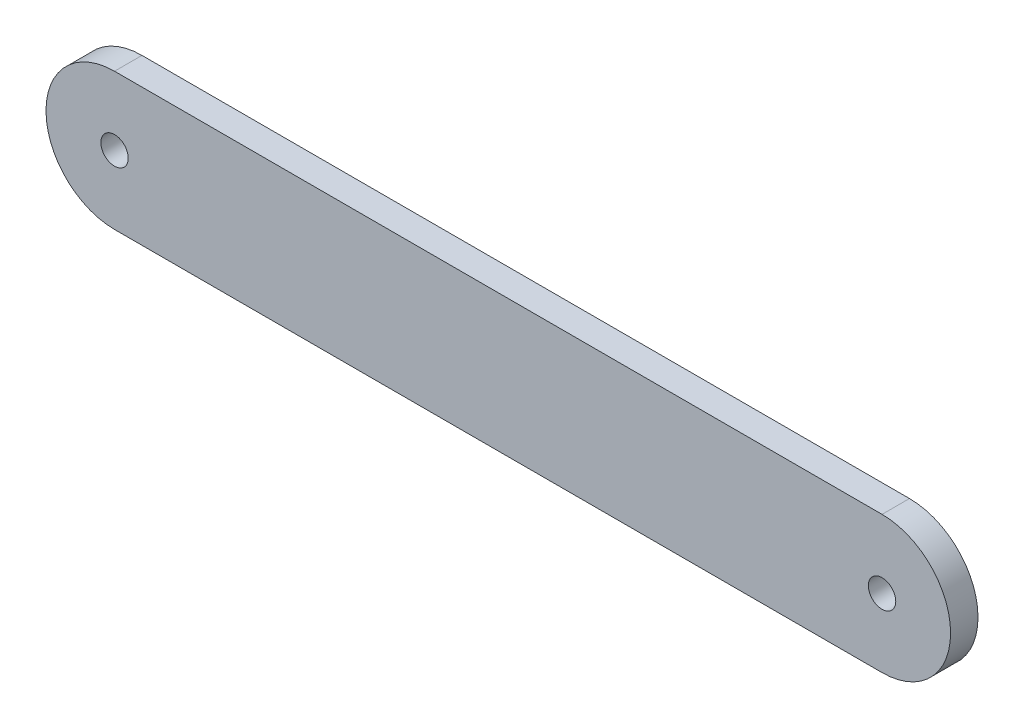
ISO-10303-21;
HEADER;
FILE_DESCRIPTION(('STEP AP214'),'2;1');
FILE_NAME('part.step','',(''),(''),'','','');
FILE_SCHEMA(('AUTOMOTIVE_DESIGN { 1 0 10303 214 1 1 1 1 }'));
ENDSEC;
DATA;
#1=APPLICATION_CONTEXT('core data for automotive mechanical design processes');
#2=APPLICATION_PROTOCOL_DEFINITION('international standard','automotive_design',2000,#1);
#3=PRODUCT_CONTEXT('',#1,'mechanical');
#4=PRODUCT('Part','Part','',(#3));
#5=PRODUCT_RELATED_PRODUCT_CATEGORY('part','',(#4));
#6=PRODUCT_DEFINITION_FORMATION('','',#4);
#7=PRODUCT_DEFINITION_CONTEXT('part definition',#1,'design');
#8=PRODUCT_DEFINITION('design','',#6,#7);
#9=PRODUCT_DEFINITION_SHAPE('','',#8);
#10=(LENGTH_UNIT() NAMED_UNIT(*) SI_UNIT(.MILLI.,.METRE.));
#11=(NAMED_UNIT(*) PLANE_ANGLE_UNIT() SI_UNIT($,.RADIAN.));
#12=(NAMED_UNIT(*) SI_UNIT($,.STERADIAN.) SOLID_ANGLE_UNIT());
#13=UNCERTAINTY_MEASURE_WITH_UNIT(LENGTH_MEASURE(1.E-05),#10,'distance_accuracy_value','');
#14=(GEOMETRIC_REPRESENTATION_CONTEXT(3) GLOBAL_UNCERTAINTY_ASSIGNED_CONTEXT((#13)) GLOBAL_UNIT_ASSIGNED_CONTEXT((#10,
#11,#12)) REPRESENTATION_CONTEXT('',''));
#15=CARTESIAN_POINT('',(0.,0.,0.));
#16=DIRECTION('',(0.,0.,1.));
#17=DIRECTION('',(1.,0.,0.));
#18=AXIS2_PLACEMENT_3D('',#15,#16,#17);
#19=CARTESIAN_POINT('',(0.,0.,10.));
#20=DIRECTION('',(0.,0.,-1.));
#21=DIRECTION('',(-1.,0.,0.));
#22=AXIS2_PLACEMENT_3D('',#19,#20,#21);
#23=CYLINDRICAL_SURFACE('',#22,25.);
#24=CARTESIAN_POINT('',(0.,0.,0.));
#25=DIRECTION('',(0.,0.,1.));
#26=DIRECTION('',(1.,0.,0.));
#27=AXIS2_PLACEMENT_3D('',#24,#25,#26);
#28=CIRCLE('',#27,25.);
#29=CARTESIAN_POINT('',(0.,25.,0.));
#30=VERTEX_POINT('',#29);
#31=CARTESIAN_POINT('',(0.,-25.,0.));
#32=VERTEX_POINT('',#31);
#33=EDGE_CURVE('E95',#30,#32,#28,.T.);
#34=ORIENTED_EDGE('',*,*,#33,.T.);
#35=DIRECTION('',(0.,0.,-1.));
#36=VECTOR('',#35,1.);
#37=CARTESIAN_POINT('',(0.,-25.,10.));
#38=LINE('',#37,#36);
#39=CARTESIAN_POINT('',(0.,-25.,10.));
#40=VERTEX_POINT('',#39);
#41=EDGE_CURVE('E11',#40,#32,#38,.T.);
#42=ORIENTED_EDGE('',*,*,#41,.F.);
#43=CARTESIAN_POINT('',(0.,0.,10.));
#44=DIRECTION('',(0.,0.,1.));
#45=DIRECTION('',(1.,0.,0.));
#46=AXIS2_PLACEMENT_3D('',#43,#44,#45);
#47=CIRCLE('',#46,25.);
#48=CARTESIAN_POINT('',(0.,25.,10.));
#49=VERTEX_POINT('',#48);
#50=EDGE_CURVE('E83',#49,#40,#47,.T.);
#51=ORIENTED_EDGE('',*,*,#50,.F.);
#52=DIRECTION('',(0.,0.,-1.));
#53=VECTOR('',#52,1.);
#54=CARTESIAN_POINT('',(0.,25.,10.));
#55=LINE('',#54,#53);
#56=EDGE_CURVE('E91',#49,#30,#55,.T.);
#57=ORIENTED_EDGE('',*,*,#56,.T.);
#58=EDGE_LOOP('',(#34,#42,#51,#57));
#59=FACE_BOUND('',#58,.T.);
#60=ADVANCED_FACE('F32',(#59),#23,.T.);
#61=CARTESIAN_POINT('',(0.,-25.,10.));
#62=DIRECTION('',(0.,1.,0.));
#63=DIRECTION('',(0.,0.,1.));
#64=AXIS2_PLACEMENT_3D('',#61,#62,#63);
#65=PLANE('',#64);
#66=DIRECTION('',(1.,0.,0.));
#67=VECTOR('',#66,1.);
#68=CARTESIAN_POINT('',(0.,-25.,0.));
#69=LINE('',#68,#67);
#70=CARTESIAN_POINT('',(280.,-25.,0.));
#71=VERTEX_POINT('',#70);
#72=EDGE_CURVE('E87',#32,#71,#69,.T.);
#73=ORIENTED_EDGE('',*,*,#72,.T.);
#74=DIRECTION('',(0.,0.,-1.));
#75=VECTOR('',#74,1.);
#76=CARTESIAN_POINT('',(280.,-25.,10.));
#77=LINE('',#76,#75);
#78=CARTESIAN_POINT('',(280.,-25.,10.));
#79=VERTEX_POINT('',#78);
#80=EDGE_CURVE('E40',#79,#71,#77,.T.);
#81=ORIENTED_EDGE('',*,*,#80,.F.);
#82=DIRECTION('',(1.,0.,0.));
#83=VECTOR('',#82,1.);
#84=CARTESIAN_POINT('',(0.,-25.,10.));
#85=LINE('',#84,#83);
#86=EDGE_CURVE('E78',#40,#79,#85,.T.);
#87=ORIENTED_EDGE('',*,*,#86,.F.);
#88=ORIENTED_EDGE('',*,*,#41,.T.);
#89=EDGE_LOOP('',(#73,#81,#87,#88));
#90=FACE_BOUND('',#89,.T.);
#91=ADVANCED_FACE('F86',(#90),#65,.F.);
#92=CARTESIAN_POINT('',(280.,0.,10.));
#93=DIRECTION('',(0.,0.,-1.));
#94=DIRECTION('',(-1.,0.,0.));
#95=AXIS2_PLACEMENT_3D('',#92,#93,#94);
#96=CYLINDRICAL_SURFACE('',#95,25.);
#97=CARTESIAN_POINT('',(280.,0.,0.));
#98=DIRECTION('',(0.,0.,1.));
#99=DIRECTION('',(1.,0.,0.));
#100=AXIS2_PLACEMENT_3D('',#97,#98,#99);
#101=CIRCLE('',#100,25.);
#102=CARTESIAN_POINT('',(280.,25.,0.));
#103=VERTEX_POINT('',#102);
#104=EDGE_CURVE('E65',#71,#103,#101,.T.);
#105=ORIENTED_EDGE('',*,*,#104,.T.);
#106=DIRECTION('',(0.,0.,-1.));
#107=VECTOR('',#106,1.);
#108=CARTESIAN_POINT('',(280.,25.,10.));
#109=LINE('',#108,#107);
#110=CARTESIAN_POINT('',(280.,25.,10.));
#111=VERTEX_POINT('',#110);
#112=EDGE_CURVE('E88',#111,#103,#109,.T.);
#113=ORIENTED_EDGE('',*,*,#112,.F.);
#114=CARTESIAN_POINT('',(280.,0.,10.));
#115=DIRECTION('',(0.,0.,1.));
#116=DIRECTION('',(1.,0.,0.));
#117=AXIS2_PLACEMENT_3D('',#114,#115,#116);
#118=CIRCLE('',#117,25.);
#119=EDGE_CURVE('E81',#79,#111,#118,.T.);
#120=ORIENTED_EDGE('',*,*,#119,.F.);
#121=ORIENTED_EDGE('',*,*,#80,.T.);
#122=EDGE_LOOP('',(#105,#113,#120,#121));
#123=FACE_BOUND('',#122,.T.);
#124=ADVANCED_FACE('F89',(#123),#96,.T.);
#125=CARTESIAN_POINT('',(0.,25.,10.));
#126=DIRECTION('',(0.,-1.,0.));
#127=DIRECTION('',(0.,0.,-1.));
#128=AXIS2_PLACEMENT_3D('',#125,#126,#127);
#129=PLANE('',#128);
#130=DIRECTION('',(-1.,0.,0.));
#131=VECTOR('',#130,1.);
#132=CARTESIAN_POINT('',(0.,25.,0.));
#133=LINE('',#132,#131);
#134=EDGE_CURVE('E71',#103,#30,#133,.T.);
#135=ORIENTED_EDGE('',*,*,#134,.T.);
#136=ORIENTED_EDGE('',*,*,#56,.F.);
#137=DIRECTION('',(-1.,0.,0.));
#138=VECTOR('',#137,1.);
#139=CARTESIAN_POINT('',(0.,25.,10.));
#140=LINE('',#139,#138);
#141=EDGE_CURVE('E48',#111,#49,#140,.T.);
#142=ORIENTED_EDGE('',*,*,#141,.F.);
#143=ORIENTED_EDGE('',*,*,#112,.T.);
#144=EDGE_LOOP('',(#135,#136,#142,#143));
#145=FACE_BOUND('',#144,.T.);
#146=ADVANCED_FACE('F103',(#145),#129,.F.);
#147=CARTESIAN_POINT('',(0.,0.,10.));
#148=DIRECTION('',(0.,0.,1.));
#149=DIRECTION('',(1.,0.,0.));
#150=AXIS2_PLACEMENT_3D('',#147,#148,#149);
#151=PLANE('',#150);
#152=CARTESIAN_POINT('',(0.,0.,10.));
#153=DIRECTION('',(0.,0.,1.));
#154=DIRECTION('',(1.,0.,0.));
#155=AXIS2_PLACEMENT_3D('',#152,#153,#154);
#156=CIRCLE('',#155,5.);
#157=CARTESIAN_POINT('',(5.,0.,10.));
#158=VERTEX_POINT('',#157);
#159=EDGE_CURVE('E115',#158,#158,#156,.T.);
#160=ORIENTED_EDGE('',*,*,#159,.F.);
#161=EDGE_LOOP('',(#160));
#162=FACE_BOUND('',#161,.T.);
#163=CARTESIAN_POINT('',(280.,0.,10.));
#164=DIRECTION('',(0.,0.,1.));
#165=DIRECTION('',(1.,0.,0.));
#166=AXIS2_PLACEMENT_3D('',#163,#164,#165);
#167=CIRCLE('',#166,4.99999999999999);
#168=CARTESIAN_POINT('',(285.,0.,10.));
#169=VERTEX_POINT('',#168);
#170=EDGE_CURVE('E109',#169,#169,#167,.T.);
#171=ORIENTED_EDGE('',*,*,#170,.F.);
#172=EDGE_LOOP('',(#171));
#173=FACE_BOUND('',#172,.T.);
#174=ORIENTED_EDGE('',*,*,#50,.T.);
#175=ORIENTED_EDGE('',*,*,#86,.T.);
#176=ORIENTED_EDGE('',*,*,#119,.T.);
#177=ORIENTED_EDGE('',*,*,#141,.T.);
#178=EDGE_LOOP('',(#174,#175,#176,#177));
#179=FACE_BOUND('',#178,.T.);
#180=ADVANCED_FACE('F79',(#162,#173,#179),#151,.T.);
#181=CARTESIAN_POINT('',(0.,0.,0.));
#182=DIRECTION('',(0.,0.,1.));
#183=DIRECTION('',(1.,0.,0.));
#184=AXIS2_PLACEMENT_3D('',#181,#182,#183);
#185=PLANE('',#184);
#186=CARTESIAN_POINT('',(0.,0.,0.));
#187=DIRECTION('',(0.,0.,1.));
#188=DIRECTION('',(1.,0.,0.));
#189=AXIS2_PLACEMENT_3D('',#186,#187,#188);
#190=CIRCLE('',#189,5.);
#191=CARTESIAN_POINT('',(5.,0.,0.));
#192=VERTEX_POINT('',#191);
#193=EDGE_CURVE('E98',#192,#192,#190,.T.);
#194=ORIENTED_EDGE('',*,*,#193,.T.);
#195=EDGE_LOOP('',(#194));
#196=FACE_BOUND('',#195,.T.);
#197=CARTESIAN_POINT('',(280.,0.,0.));
#198=DIRECTION('',(0.,0.,1.));
#199=DIRECTION('',(1.,0.,0.));
#200=AXIS2_PLACEMENT_3D('',#197,#198,#199);
#201=CIRCLE('',#200,4.99999999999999);
#202=CARTESIAN_POINT('',(285.,0.,0.));
#203=VERTEX_POINT('',#202);
#204=EDGE_CURVE('E112',#203,#203,#201,.T.);
#205=ORIENTED_EDGE('',*,*,#204,.T.);
#206=EDGE_LOOP('',(#205));
#207=FACE_BOUND('',#206,.T.);
#208=ORIENTED_EDGE('',*,*,#33,.F.);
#209=ORIENTED_EDGE('',*,*,#134,.F.);
#210=ORIENTED_EDGE('',*,*,#104,.F.);
#211=ORIENTED_EDGE('',*,*,#72,.F.);
#212=EDGE_LOOP('',(#208,#209,#210,#211));
#213=FACE_BOUND('',#212,.T.);
#214=ADVANCED_FACE('F106',(#196,#207,#213),#185,.F.);
#215=CARTESIAN_POINT('',(280.,0.,0.));
#216=DIRECTION('',(0.,0.,1.));
#217=DIRECTION('',(1.,0.,0.));
#218=AXIS2_PLACEMENT_3D('',#215,#216,#217);
#219=CYLINDRICAL_SURFACE('',#218,4.99999999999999);
#220=ORIENTED_EDGE('',*,*,#204,.F.);
#221=EDGE_LOOP('',(#220));
#222=FACE_BOUND('',#221,.T.);
#223=ORIENTED_EDGE('',*,*,#170,.T.);
#224=EDGE_LOOP('',(#223));
#225=FACE_BOUND('',#224,.T.);
#226=ADVANCED_FACE('F126',(#222,#225),#219,.F.);
#227=CARTESIAN_POINT('',(0.,0.,0.));
#228=DIRECTION('',(0.,0.,1.));
#229=DIRECTION('',(1.,0.,0.));
#230=AXIS2_PLACEMENT_3D('',#227,#228,#229);
#231=CYLINDRICAL_SURFACE('',#230,5.);
#232=ORIENTED_EDGE('',*,*,#193,.F.);
#233=EDGE_LOOP('',(#232));
#234=FACE_BOUND('',#233,.T.);
#235=ORIENTED_EDGE('',*,*,#159,.T.);
#236=EDGE_LOOP('',(#235));
#237=FACE_BOUND('',#236,.T.);
#238=ADVANCED_FACE('F123',(#234,#237),#231,.F.);
#239=CLOSED_SHELL('',(#60,#91,#124,#146,#180,#214,#226,#238));
#240=MANIFOLD_SOLID_BREP('B2',#239);
#241=ADVANCED_BREP_SHAPE_REPRESENTATION('',(#18,#240),#14);
#242=SHAPE_DEFINITION_REPRESENTATION(#9,#241);
ENDSEC;
END-ISO-10303-21;
